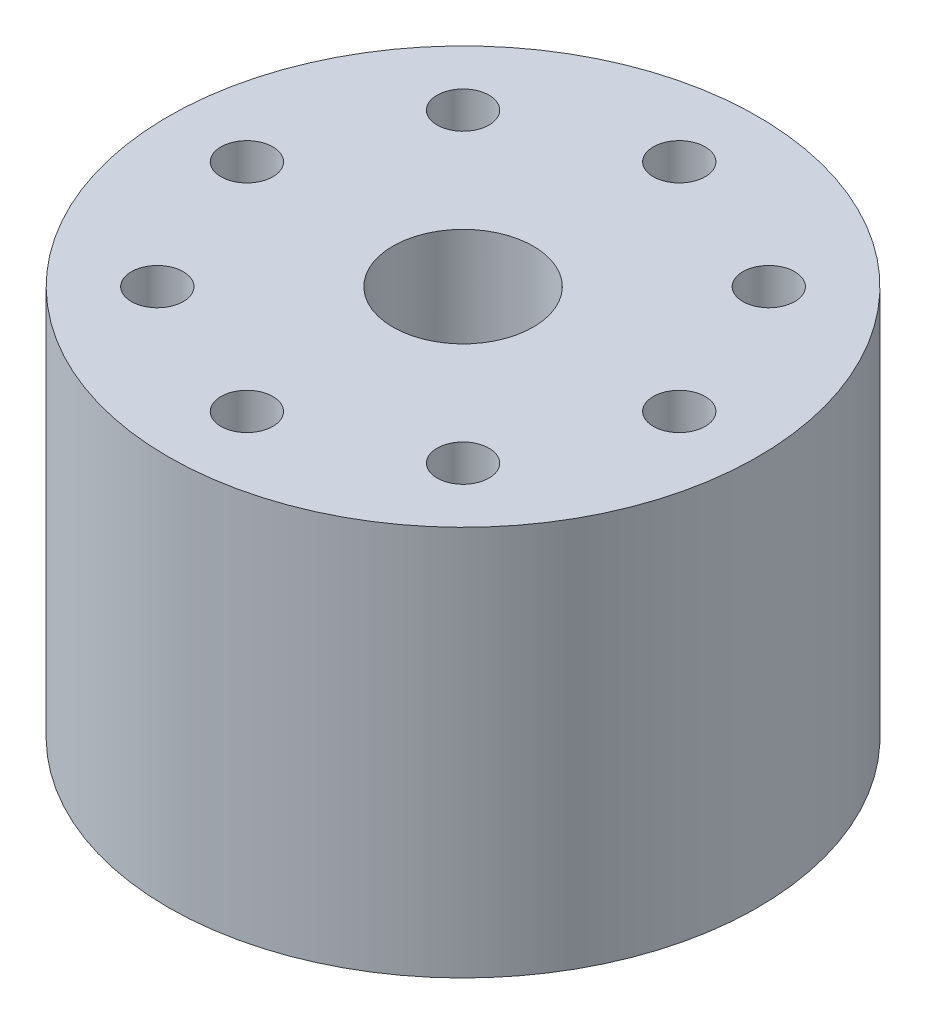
ISO-10303-21;
HEADER;
FILE_DESCRIPTION(('STEP AP214'),'2;1');
FILE_NAME('part.step','',(''),(''),'','','');
FILE_SCHEMA(('AUTOMOTIVE_DESIGN { 1 0 10303 214 1 1 1 1 }'));
ENDSEC;
DATA;
#1=APPLICATION_CONTEXT('core data for automotive mechanical design processes');
#2=APPLICATION_PROTOCOL_DEFINITION('international standard','automotive_design',2000,#1);
#3=PRODUCT_CONTEXT('',#1,'mechanical');
#4=PRODUCT('Part','Part','',(#3));
#5=PRODUCT_RELATED_PRODUCT_CATEGORY('part','',(#4));
#6=PRODUCT_DEFINITION_FORMATION('','',#4);
#7=PRODUCT_DEFINITION_CONTEXT('part definition',#1,'design');
#8=PRODUCT_DEFINITION('design','',#6,#7);
#9=PRODUCT_DEFINITION_SHAPE('','',#8);
#10=(LENGTH_UNIT() NAMED_UNIT(*) SI_UNIT(.MILLI.,.METRE.));
#11=(NAMED_UNIT(*) PLANE_ANGLE_UNIT() SI_UNIT($,.RADIAN.));
#12=(NAMED_UNIT(*) SI_UNIT($,.STERADIAN.) SOLID_ANGLE_UNIT());
#13=UNCERTAINTY_MEASURE_WITH_UNIT(LENGTH_MEASURE(1.E-05),#10,'distance_accuracy_value','');
#14=(GEOMETRIC_REPRESENTATION_CONTEXT(3) GLOBAL_UNCERTAINTY_ASSIGNED_CONTEXT((#13)) GLOBAL_UNIT_ASSIGNED_CONTEXT((#10,
#11,#12)) REPRESENTATION_CONTEXT('',''));
#15=CARTESIAN_POINT('',(0.,0.,0.));
#16=DIRECTION('',(0.,0.,1.));
#17=DIRECTION('',(1.,0.,0.));
#18=AXIS2_PLACEMENT_3D('',#15,#16,#17);
#19=CARTESIAN_POINT('',(0.,49.65,0.));
#20=DIRECTION('',(0.,-1.,0.));
#21=DIRECTION('',(0.,0.,-1.));
#22=AXIS2_PLACEMENT_3D('',#19,#20,#21);
#23=CYLINDRICAL_SURFACE('',#22,37.5);
#24=CARTESIAN_POINT('',(0.,49.65,0.));
#25=DIRECTION('',(0.,1.,0.));
#26=DIRECTION('',(0.,0.,1.));
#27=AXIS2_PLACEMENT_3D('',#24,#25,#26);
#28=CIRCLE('',#27,37.5);
#29=CARTESIAN_POINT('',(0.,49.65,37.5));
#30=VERTEX_POINT('',#29);
#31=EDGE_CURVE('E54',#30,#30,#28,.T.);
#32=ORIENTED_EDGE('',*,*,#31,.F.);
#33=EDGE_LOOP('',(#32));
#34=FACE_BOUND('',#33,.T.);
#35=CARTESIAN_POINT('',(0.,0.,0.));
#36=DIRECTION('',(0.,1.,0.));
#37=DIRECTION('',(0.,0.,1.));
#38=AXIS2_PLACEMENT_3D('',#35,#36,#37);
#39=CIRCLE('',#38,37.5);
#40=CARTESIAN_POINT('',(0.,0.,37.5));
#41=VERTEX_POINT('',#40);
#42=EDGE_CURVE('E58',#41,#41,#39,.T.);
#43=ORIENTED_EDGE('',*,*,#42,.T.);
#44=EDGE_LOOP('',(#43));
#45=FACE_BOUND('',#44,.T.);
#46=ADVANCED_FACE('F43',(#34,#45),#23,.T.);
#47=CARTESIAN_POINT('',(0.,49.65,0.));
#48=DIRECTION('',(0.,1.,0.));
#49=DIRECTION('',(0.,0.,1.));
#50=AXIS2_PLACEMENT_3D('',#47,#48,#49);
#51=PLANE('',#50);
#52=CARTESIAN_POINT('',(0.,49.65,27.5));
#53=DIRECTION('',(0.,1.,0.));
#54=DIRECTION('',(0.,0.,1.));
#55=AXIS2_PLACEMENT_3D('',#52,#53,#54);
#56=CIRCLE('',#55,3.3);
#57=CARTESIAN_POINT('',(0.,49.65,30.8));
#58=VERTEX_POINT('',#57);
#59=EDGE_CURVE('E273',#58,#58,#56,.T.);
#60=ORIENTED_EDGE('',*,*,#59,.F.);
#61=EDGE_LOOP('',(#60));
#62=FACE_BOUND('',#61,.T.);
#63=CARTESIAN_POINT('',(-19.4454364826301,49.65,19.44543648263));
#64=DIRECTION('',(0.,1.,0.));
#65=DIRECTION('',(0.,0.,1.));
#66=AXIS2_PLACEMENT_3D('',#63,#64,#65);
#67=CIRCLE('',#66,3.3);
#68=CARTESIAN_POINT('',(-19.4454364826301,49.65,22.74543648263));
#69=VERTEX_POINT('',#68);
#70=EDGE_CURVE('E279',#69,#69,#67,.T.);
#71=ORIENTED_EDGE('',*,*,#70,.F.);
#72=EDGE_LOOP('',(#71));
#73=FACE_BOUND('',#72,.T.);
#74=CARTESIAN_POINT('',(-27.5,49.65,0.));
#75=DIRECTION('',(0.,1.,0.));
#76=DIRECTION('',(0.,0.,1.));
#77=AXIS2_PLACEMENT_3D('',#74,#75,#76);
#78=CIRCLE('',#77,3.3);
#79=CARTESIAN_POINT('',(-27.5,49.65,3.2999999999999));
#80=VERTEX_POINT('',#79);
#81=EDGE_CURVE('E290',#80,#80,#78,.T.);
#82=ORIENTED_EDGE('',*,*,#81,.F.);
#83=EDGE_LOOP('',(#82));
#84=FACE_BOUND('',#83,.T.);
#85=CARTESIAN_POINT('',(-19.44543648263,49.65,-19.4454364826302));
#86=DIRECTION('',(0.,1.,0.));
#87=DIRECTION('',(0.,0.,1.));
#88=AXIS2_PLACEMENT_3D('',#85,#86,#87);
#89=CIRCLE('',#88,3.3);
#90=CARTESIAN_POINT('',(-19.44543648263,49.65,-16.1454364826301));
#91=VERTEX_POINT('',#90);
#92=EDGE_CURVE('E296',#91,#91,#89,.T.);
#93=ORIENTED_EDGE('',*,*,#92,.F.);
#94=EDGE_LOOP('',(#93));
#95=FACE_BOUND('',#94,.T.);
#96=CARTESIAN_POINT('',(1.92031473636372E-13,49.65,-27.5));
#97=DIRECTION('',(0.,1.,0.));
#98=DIRECTION('',(0.,0.,1.));
#99=AXIS2_PLACEMENT_3D('',#96,#97,#98);
#100=CIRCLE('',#99,3.3);
#101=CARTESIAN_POINT('',(1.92031473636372E-13,49.65,-24.2));
#102=VERTEX_POINT('',#101);
#103=EDGE_CURVE('E302',#102,#102,#100,.T.);
#104=ORIENTED_EDGE('',*,*,#103,.F.);
#105=EDGE_LOOP('',(#104));
#106=FACE_BOUND('',#105,.T.);
#107=CARTESIAN_POINT('',(19.4454364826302,49.65,-19.4454364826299));
#108=DIRECTION('',(0.,1.,0.));
#109=DIRECTION('',(0.,0.,1.));
#110=AXIS2_PLACEMENT_3D('',#107,#108,#109);
#111=CIRCLE('',#110,3.3);
#112=CARTESIAN_POINT('',(19.4454364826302,49.65,-16.1454364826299));
#113=VERTEX_POINT('',#112);
#114=EDGE_CURVE('E331',#113,#113,#111,.T.);
#115=ORIENTED_EDGE('',*,*,#114,.F.);
#116=EDGE_LOOP('',(#115));
#117=FACE_BOUND('',#116,.T.);
#118=CARTESIAN_POINT('',(27.5,49.65,2.88047210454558E-13));
#119=DIRECTION('',(0.,1.,0.));
#120=DIRECTION('',(0.,0.,1.));
#121=AXIS2_PLACEMENT_3D('',#118,#119,#120);
#122=CIRCLE('',#121,3.3);
#123=CARTESIAN_POINT('',(27.5,49.65,3.30000000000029));
#124=VERTEX_POINT('',#123);
#125=EDGE_CURVE('E338',#124,#124,#122,.T.);
#126=ORIENTED_EDGE('',*,*,#125,.F.);
#127=EDGE_LOOP('',(#126));
#128=FACE_BOUND('',#127,.T.);
#129=CARTESIAN_POINT('',(19.4454364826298,49.65,19.4454364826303));
#130=DIRECTION('',(0.,1.,0.));
#131=DIRECTION('',(0.,0.,1.));
#132=AXIS2_PLACEMENT_3D('',#129,#130,#131);
#133=CIRCLE('',#132,3.3);
#134=CARTESIAN_POINT('',(19.4454364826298,49.65,22.7454364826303));
#135=VERTEX_POINT('',#134);
#136=EDGE_CURVE('E274',#135,#135,#133,.T.);
#137=ORIENTED_EDGE('',*,*,#136,.F.);
#138=EDGE_LOOP('',(#137));
#139=FACE_BOUND('',#138,.T.);
#140=CARTESIAN_POINT('',(0.,49.65,0.));
#141=DIRECTION('',(0.,1.,0.));
#142=DIRECTION('',(0.,0.,1.));
#143=AXIS2_PLACEMENT_3D('',#140,#141,#142);
#144=CIRCLE('',#143,8.93);
#145=CARTESIAN_POINT('',(0.,49.65,8.93));
#146=VERTEX_POINT('',#145);
#147=EDGE_CURVE('E62',#146,#146,#144,.T.);
#148=ORIENTED_EDGE('',*,*,#147,.F.);
#149=EDGE_LOOP('',(#148));
#150=FACE_BOUND('',#149,.T.);
#151=ORIENTED_EDGE('',*,*,#31,.T.);
#152=EDGE_LOOP('',(#151));
#153=FACE_BOUND('',#152,.T.);
#154=ADVANCED_FACE('F104',(#62,#73,#84,#95,#106,#117,#128,#139,#150,#153),#51,.T.);
#155=CARTESIAN_POINT('',(0.,0.,0.));
#156=DIRECTION('',(0.,1.,0.));
#157=DIRECTION('',(0.,0.,1.));
#158=AXIS2_PLACEMENT_3D('',#155,#156,#157);
#159=PLANE('',#158);
#160=CARTESIAN_POINT('',(0.,0.,27.5));
#161=DIRECTION('',(0.,1.,0.));
#162=DIRECTION('',(0.,0.,1.));
#163=AXIS2_PLACEMENT_3D('',#160,#161,#162);
#164=CIRCLE('',#163,3.3);
#165=CARTESIAN_POINT('',(0.,0.,30.8));
#166=VERTEX_POINT('',#165);
#167=EDGE_CURVE('E270',#166,#166,#164,.T.);
#168=ORIENTED_EDGE('',*,*,#167,.T.);
#169=EDGE_LOOP('',(#168));
#170=FACE_BOUND('',#169,.T.);
#171=CARTESIAN_POINT('',(-19.4454364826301,0.,19.44543648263));
#172=DIRECTION('',(0.,1.,0.));
#173=DIRECTION('',(0.,0.,1.));
#174=AXIS2_PLACEMENT_3D('',#171,#172,#173);
#175=CIRCLE('',#174,3.3);
#176=CARTESIAN_POINT('',(-19.4454364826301,0.,22.74543648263));
#177=VERTEX_POINT('',#176);
#178=EDGE_CURVE('E287',#177,#177,#175,.T.);
#179=ORIENTED_EDGE('',*,*,#178,.T.);
#180=EDGE_LOOP('',(#179));
#181=FACE_BOUND('',#180,.T.);
#182=CARTESIAN_POINT('',(-27.5,0.,0.));
#183=DIRECTION('',(0.,1.,0.));
#184=DIRECTION('',(0.,0.,1.));
#185=AXIS2_PLACEMENT_3D('',#182,#183,#184);
#186=CIRCLE('',#185,3.3);
#187=CARTESIAN_POINT('',(-27.5,0.,3.2999999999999));
#188=VERTEX_POINT('',#187);
#189=EDGE_CURVE('E293',#188,#188,#186,.T.);
#190=ORIENTED_EDGE('',*,*,#189,.T.);
#191=EDGE_LOOP('',(#190));
#192=FACE_BOUND('',#191,.T.);
#193=CARTESIAN_POINT('',(-19.44543648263,0.,-19.4454364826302));
#194=DIRECTION('',(0.,1.,0.));
#195=DIRECTION('',(0.,0.,1.));
#196=AXIS2_PLACEMENT_3D('',#193,#194,#195);
#197=CIRCLE('',#196,3.3);
#198=CARTESIAN_POINT('',(-19.44543648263,0.,-16.1454364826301));
#199=VERTEX_POINT('',#198);
#200=EDGE_CURVE('E299',#199,#199,#197,.T.);
#201=ORIENTED_EDGE('',*,*,#200,.T.);
#202=EDGE_LOOP('',(#201));
#203=FACE_BOUND('',#202,.T.);
#204=CARTESIAN_POINT('',(1.92031473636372E-13,0.,-27.5));
#205=DIRECTION('',(0.,1.,0.));
#206=DIRECTION('',(0.,0.,1.));
#207=AXIS2_PLACEMENT_3D('',#204,#205,#206);
#208=CIRCLE('',#207,3.3);
#209=CARTESIAN_POINT('',(1.92031473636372E-13,0.,-24.2));
#210=VERTEX_POINT('',#209);
#211=EDGE_CURVE('E326',#210,#210,#208,.T.);
#212=ORIENTED_EDGE('',*,*,#211,.T.);
#213=EDGE_LOOP('',(#212));
#214=FACE_BOUND('',#213,.T.);
#215=CARTESIAN_POINT('',(19.4454364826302,0.,-19.4454364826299));
#216=DIRECTION('',(0.,1.,0.));
#217=DIRECTION('',(0.,0.,1.));
#218=AXIS2_PLACEMENT_3D('',#215,#216,#217);
#219=CIRCLE('',#218,3.3);
#220=CARTESIAN_POINT('',(19.4454364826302,0.,-16.1454364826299));
#221=VERTEX_POINT('',#220);
#222=EDGE_CURVE('E336',#221,#221,#219,.T.);
#223=ORIENTED_EDGE('',*,*,#222,.T.);
#224=EDGE_LOOP('',(#223));
#225=FACE_BOUND('',#224,.T.);
#226=CARTESIAN_POINT('',(27.5,0.,2.88047210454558E-13));
#227=DIRECTION('',(0.,1.,0.));
#228=DIRECTION('',(0.,0.,1.));
#229=AXIS2_PLACEMENT_3D('',#226,#227,#228);
#230=CIRCLE('',#229,3.3);
#231=CARTESIAN_POINT('',(27.5,0.,3.30000000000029));
#232=VERTEX_POINT('',#231);
#233=EDGE_CURVE('E282',#232,#232,#230,.T.);
#234=ORIENTED_EDGE('',*,*,#233,.T.);
#235=EDGE_LOOP('',(#234));
#236=FACE_BOUND('',#235,.T.);
#237=CARTESIAN_POINT('',(19.4454364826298,0.,19.4454364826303));
#238=DIRECTION('',(0.,1.,0.));
#239=DIRECTION('',(0.,0.,1.));
#240=AXIS2_PLACEMENT_3D('',#237,#238,#239);
#241=CIRCLE('',#240,3.3);
#242=CARTESIAN_POINT('',(19.4454364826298,0.,22.7454364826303));
#243=VERTEX_POINT('',#242);
#244=EDGE_CURVE('E277',#243,#243,#241,.T.);
#245=ORIENTED_EDGE('',*,*,#244,.T.);
#246=EDGE_LOOP('',(#245));
#247=FACE_BOUND('',#246,.T.);
#248=CARTESIAN_POINT('',(0.,0.,0.));
#249=DIRECTION('',(0.,-1.,0.));
#250=DIRECTION('',(0.,0.,-1.));
#251=AXIS2_PLACEMENT_3D('',#248,#249,#250);
#252=CIRCLE('',#251,18.);
#253=CARTESIAN_POINT('',(0.,0.,-18.));
#254=VERTEX_POINT('',#253);
#255=EDGE_CURVE('E67',#254,#254,#252,.T.);
#256=ORIENTED_EDGE('',*,*,#255,.F.);
#257=EDGE_LOOP('',(#256));
#258=FACE_BOUND('',#257,.T.);
#259=ORIENTED_EDGE('',*,*,#42,.F.);
#260=EDGE_LOOP('',(#259));
#261=FACE_BOUND('',#260,.T.);
#262=ADVANCED_FACE('F103',(#170,#181,#192,#203,#214,#225,#236,#247,#258,#261),#159,.F.);
#263=CARTESIAN_POINT('',(0.,26.65,0.));
#264=DIRECTION('',(0.,1.,0.));
#265=DIRECTION('',(0.,0.,1.));
#266=AXIS2_PLACEMENT_3D('',#263,#264,#265);
#267=CYLINDRICAL_SURFACE('',#266,8.93);
#268=CARTESIAN_POINT('',(0.,32.6087679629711,0.));
#269=DIRECTION('',(0.,1.,0.));
#270=DIRECTION('',(0.,0.,1.));
#271=AXIS2_PLACEMENT_3D('',#268,#269,#270);
#272=CIRCLE('',#271,8.93);
#273=CARTESIAN_POINT('',(0.,32.6087679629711,8.93));
#274=VERTEX_POINT('',#273);
#275=EDGE_CURVE('E11',#274,#274,#272,.F.);
#276=ORIENTED_EDGE('',*,*,#275,.T.);
#277=EDGE_LOOP('',(#276));
#278=FACE_BOUND('',#277,.T.);
#279=ORIENTED_EDGE('',*,*,#147,.T.);
#280=EDGE_LOOP('',(#279));
#281=FACE_BOUND('',#280,.T.);
#282=ADVANCED_FACE('F96',(#278,#281),#267,.F.);
#283=CARTESIAN_POINT('',(0.,3.15,0.));
#284=DIRECTION('',(0.,-1.,0.));
#285=DIRECTION('',(0.,0.,-1.));
#286=AXIS2_PLACEMENT_3D('',#283,#284,#285);
#287=PLANE('',#286);
#288=CARTESIAN_POINT('',(0.,3.15,0.));
#289=DIRECTION('',(0.,-1.,0.));
#290=DIRECTION('',(0.,0.,-1.));
#291=AXIS2_PLACEMENT_3D('',#288,#289,#290);
#292=CIRCLE('',#291,18.);
#293=CARTESIAN_POINT('',(0.,3.15,-18.));
#294=VERTEX_POINT('',#293);
#295=EDGE_CURVE('E66',#294,#294,#292,.T.);
#296=ORIENTED_EDGE('',*,*,#295,.T.);
#297=EDGE_LOOP('',(#296));
#298=FACE_BOUND('',#297,.T.);
#299=CARTESIAN_POINT('',(0.,3.15,0.));
#300=DIRECTION('',(0.,-1.,0.));
#301=DIRECTION('',(0.,0.,-1.));
#302=AXIS2_PLACEMENT_3D('',#299,#300,#301);
#303=CIRCLE('',#302,14.);
#304=CARTESIAN_POINT('',(0.,3.15,-14.));
#305=VERTEX_POINT('',#304);
#306=EDGE_CURVE('E70',#305,#305,#303,.T.);
#307=ORIENTED_EDGE('',*,*,#306,.F.);
#308=EDGE_LOOP('',(#307));
#309=FACE_BOUND('',#308,.T.);
#310=ADVANCED_FACE('F93',(#298,#309),#287,.T.);
#311=CARTESIAN_POINT('',(0.,3.15,0.));
#312=DIRECTION('',(0.,-1.,0.));
#313=DIRECTION('',(0.,0.,-1.));
#314=AXIS2_PLACEMENT_3D('',#311,#312,#313);
#315=CYLINDRICAL_SURFACE('',#314,18.);
#316=ORIENTED_EDGE('',*,*,#295,.F.);
#317=EDGE_LOOP('',(#316));
#318=FACE_BOUND('',#317,.T.);
#319=ORIENTED_EDGE('',*,*,#255,.T.);
#320=EDGE_LOOP('',(#319));
#321=FACE_BOUND('',#320,.T.);
#322=ADVANCED_FACE('F90',(#318,#321),#315,.F.);
#323=CARTESIAN_POINT('',(-14.,23.03,0.));
#324=CARTESIAN_POINT('',(-22.4,13.09,0.));
#325=CARTESIAN_POINT('',(-14.,3.15,0.));
#326=B_SPLINE_CURVE_WITH_KNOTS('',2,(#323,#324,#325),.UNSPECIFIED.,.F.,.F.,(3,3),(0.,1.),.UNSPECIFIED.);
#327=CARTESIAN_POINT('',(0.,3.15,0.));
#328=DIRECTION('',(0.,-1.,0.));
#329=AXIS1_PLACEMENT('',#327,#328);
#330=SURFACE_OF_REVOLUTION('',#326,#329);
#331=ORIENTED_EDGE('',*,*,#306,.T.);
#332=EDGE_LOOP('',(#331));
#333=FACE_BOUND('',#332,.T.);
#334=CARTESIAN_POINT('',(0.,23.03,0.));
#335=DIRECTION('',(0.,1.,0.));
#336=DIRECTION('',(-1.,0.,0.));
#337=AXIS2_PLACEMENT_3D('',#334,#335,#336);
#338=CIRCLE('',#337,14.);
#339=CARTESIAN_POINT('',(-14.,23.03,0.));
#340=VERTEX_POINT('',#339);
#341=EDGE_CURVE('E75',#340,#340,#338,.T.);
#342=ORIENTED_EDGE('',*,*,#341,.T.);
#343=EDGE_LOOP('',(#342));
#344=FACE_BOUND('',#343,.T.);
#345=ADVANCED_FACE('F85',(#333,#344),#330,.F.);
#346=CARTESIAN_POINT('',(-14.,26.65,0.));
#347=DIRECTION('',(0.,1.,0.));
#348=DIRECTION('',(-1.,0.,0.));
#349=AXIS2_PLACEMENT_3D('',#346,#347,#348);
#350=PLANE('',#349);
#351=CARTESIAN_POINT('',(0.,26.65,0.));
#352=DIRECTION('',(0.,1.,0.));
#353=DIRECTION('',(-1.,0.,0.));
#354=AXIS2_PLACEMENT_3D('',#351,#352,#353);
#355=CIRCLE('',#354,13.93);
#356=CARTESIAN_POINT('',(-13.93,26.65,0.));
#357=VERTEX_POINT('',#356);
#358=EDGE_CURVE('E50',#357,#357,#355,.T.);
#359=ORIENTED_EDGE('',*,*,#358,.T.);
#360=EDGE_LOOP('',(#359));
#361=FACE_BOUND('',#360,.T.);
#362=CARTESIAN_POINT('',(0.,26.65,0.));
#363=DIRECTION('',(0.,1.,0.));
#364=DIRECTION('',(-1.,0.,0.));
#365=AXIS2_PLACEMENT_3D('',#362,#363,#364);
#366=CIRCLE('',#365,14.);
#367=CARTESIAN_POINT('',(-14.,26.65,0.));
#368=VERTEX_POINT('',#367);
#369=EDGE_CURVE('E304',#368,#368,#366,.T.);
#370=ORIENTED_EDGE('',*,*,#369,.F.);
#371=EDGE_LOOP('',(#370));
#372=FACE_BOUND('',#371,.T.);
#373=ADVANCED_FACE('F89',(#361,#372),#350,.F.);
#374=CARTESIAN_POINT('',(0.,26.65,0.));
#375=DIRECTION('',(0.,1.,0.));
#376=DIRECTION('',(-1.,0.,0.));
#377=AXIS2_PLACEMENT_3D('',#374,#375,#376);
#378=CYLINDRICAL_SURFACE('',#377,14.);
#379=ORIENTED_EDGE('',*,*,#341,.F.);
#380=EDGE_LOOP('',(#379));
#381=FACE_BOUND('',#380,.T.);
#382=ORIENTED_EDGE('',*,*,#369,.T.);
#383=EDGE_LOOP('',(#382));
#384=FACE_BOUND('',#383,.T.);
#385=ADVANCED_FACE('F152',(#381,#384),#378,.F.);
#386=CARTESIAN_POINT('',(19.4454364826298,0.,19.4454364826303));
#387=DIRECTION('',(0.,1.,0.));
#388=DIRECTION('',(0.,0.,1.));
#389=AXIS2_PLACEMENT_3D('',#386,#387,#388);
#390=CYLINDRICAL_SURFACE('',#389,3.3);
#391=ORIENTED_EDGE('',*,*,#244,.F.);
#392=EDGE_LOOP('',(#391));
#393=FACE_BOUND('',#392,.T.);
#394=ORIENTED_EDGE('',*,*,#136,.T.);
#395=EDGE_LOOP('',(#394));
#396=FACE_BOUND('',#395,.T.);
#397=ADVANCED_FACE('F158',(#393,#396),#390,.F.);
#398=CARTESIAN_POINT('',(27.5,0.,2.88047210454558E-13));
#399=DIRECTION('',(0.,1.,0.));
#400=DIRECTION('',(0.,0.,1.));
#401=AXIS2_PLACEMENT_3D('',#398,#399,#400);
#402=CYLINDRICAL_SURFACE('',#401,3.3);
#403=ORIENTED_EDGE('',*,*,#125,.T.);
#404=EDGE_LOOP('',(#403));
#405=FACE_BOUND('',#404,.T.);
#406=ORIENTED_EDGE('',*,*,#233,.F.);
#407=EDGE_LOOP('',(#406));
#408=FACE_BOUND('',#407,.T.);
#409=ADVANCED_FACE('F164',(#405,#408),#402,.F.);
#410=CARTESIAN_POINT('',(19.4454364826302,0.,-19.4454364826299));
#411=DIRECTION('',(0.,1.,0.));
#412=DIRECTION('',(0.,0.,1.));
#413=AXIS2_PLACEMENT_3D('',#410,#411,#412);
#414=CYLINDRICAL_SURFACE('',#413,3.3);
#415=ORIENTED_EDGE('',*,*,#222,.F.);
#416=EDGE_LOOP('',(#415));
#417=FACE_BOUND('',#416,.T.);
#418=ORIENTED_EDGE('',*,*,#114,.T.);
#419=EDGE_LOOP('',(#418));
#420=FACE_BOUND('',#419,.T.);
#421=ADVANCED_FACE('F172',(#417,#420),#414,.F.);
#422=CARTESIAN_POINT('',(1.92031473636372E-13,0.,-27.5));
#423=DIRECTION('',(0.,1.,0.));
#424=DIRECTION('',(0.,0.,1.));
#425=AXIS2_PLACEMENT_3D('',#422,#423,#424);
#426=CYLINDRICAL_SURFACE('',#425,3.3);
#427=ORIENTED_EDGE('',*,*,#211,.F.);
#428=EDGE_LOOP('',(#427));
#429=FACE_BOUND('',#428,.T.);
#430=ORIENTED_EDGE('',*,*,#103,.T.);
#431=EDGE_LOOP('',(#430));
#432=FACE_BOUND('',#431,.T.);
#433=ADVANCED_FACE('F180',(#429,#432),#426,.F.);
#434=CARTESIAN_POINT('',(-19.44543648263,0.,-19.4454364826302));
#435=DIRECTION('',(0.,1.,0.));
#436=DIRECTION('',(0.,0.,1.));
#437=AXIS2_PLACEMENT_3D('',#434,#435,#436);
#438=CYLINDRICAL_SURFACE('',#437,3.3);
#439=ORIENTED_EDGE('',*,*,#200,.F.);
#440=EDGE_LOOP('',(#439));
#441=FACE_BOUND('',#440,.T.);
#442=ORIENTED_EDGE('',*,*,#92,.T.);
#443=EDGE_LOOP('',(#442));
#444=FACE_BOUND('',#443,.T.);
#445=ADVANCED_FACE('F188',(#441,#444),#438,.F.);
#446=CARTESIAN_POINT('',(-27.5,0.,0.));
#447=DIRECTION('',(0.,1.,0.));
#448=DIRECTION('',(0.,0.,1.));
#449=AXIS2_PLACEMENT_3D('',#446,#447,#448);
#450=CYLINDRICAL_SURFACE('',#449,3.3);
#451=ORIENTED_EDGE('',*,*,#189,.F.);
#452=EDGE_LOOP('',(#451));
#453=FACE_BOUND('',#452,.T.);
#454=ORIENTED_EDGE('',*,*,#81,.T.);
#455=EDGE_LOOP('',(#454));
#456=FACE_BOUND('',#455,.T.);
#457=ADVANCED_FACE('F196',(#453,#456),#450,.F.);
#458=CARTESIAN_POINT('',(-19.4454364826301,0.,19.44543648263));
#459=DIRECTION('',(0.,1.,0.));
#460=DIRECTION('',(0.,0.,1.));
#461=AXIS2_PLACEMENT_3D('',#458,#459,#460);
#462=CYLINDRICAL_SURFACE('',#461,3.3);
#463=ORIENTED_EDGE('',*,*,#178,.F.);
#464=EDGE_LOOP('',(#463));
#465=FACE_BOUND('',#464,.T.);
#466=ORIENTED_EDGE('',*,*,#70,.T.);
#467=EDGE_LOOP('',(#466));
#468=FACE_BOUND('',#467,.T.);
#469=ADVANCED_FACE('F204',(#465,#468),#462,.F.);
#470=CARTESIAN_POINT('',(0.,0.,27.5));
#471=DIRECTION('',(0.,1.,0.));
#472=DIRECTION('',(0.,0.,1.));
#473=AXIS2_PLACEMENT_3D('',#470,#471,#472);
#474=CYLINDRICAL_SURFACE('',#473,3.3);
#475=ORIENTED_EDGE('',*,*,#167,.F.);
#476=EDGE_LOOP('',(#475));
#477=FACE_BOUND('',#476,.T.);
#478=ORIENTED_EDGE('',*,*,#59,.T.);
#479=EDGE_LOOP('',(#478));
#480=FACE_BOUND('',#479,.T.);
#481=ADVANCED_FACE('F212',(#477,#480),#474,.F.);
#482=CARTESIAN_POINT('',(0.,26.65,0.));
#483=DIRECTION('',(0.,-1.,0.));
#484=DIRECTION('',(0.,0.,-1.));
#485=AXIS2_PLACEMENT_3D('',#482,#483,#484);
#486=CONICAL_SURFACE('',#485,13.93,0.698131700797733);
#487=ORIENTED_EDGE('',*,*,#275,.F.);
#488=EDGE_LOOP('',(#487));
#489=FACE_BOUND('',#488,.T.);
#490=ORIENTED_EDGE('',*,*,#358,.F.);
#491=EDGE_LOOP('',(#490));
#492=FACE_BOUND('',#491,.T.);
#493=ADVANCED_FACE('F45',(#489,#492),#486,.F.);
#494=CLOSED_SHELL('',(#46,#154,#262,#282,#310,#322,#345,#373,#385,#397,#409,#421,#433,#445,#457,
#469,#481,#493));
#495=MANIFOLD_SOLID_BREP('B2',#494);
#496=ADVANCED_BREP_SHAPE_REPRESENTATION('',(#18,#495),#14);
#497=SHAPE_DEFINITION_REPRESENTATION(#9,#496);
ENDSEC;
END-ISO-10303-21;
